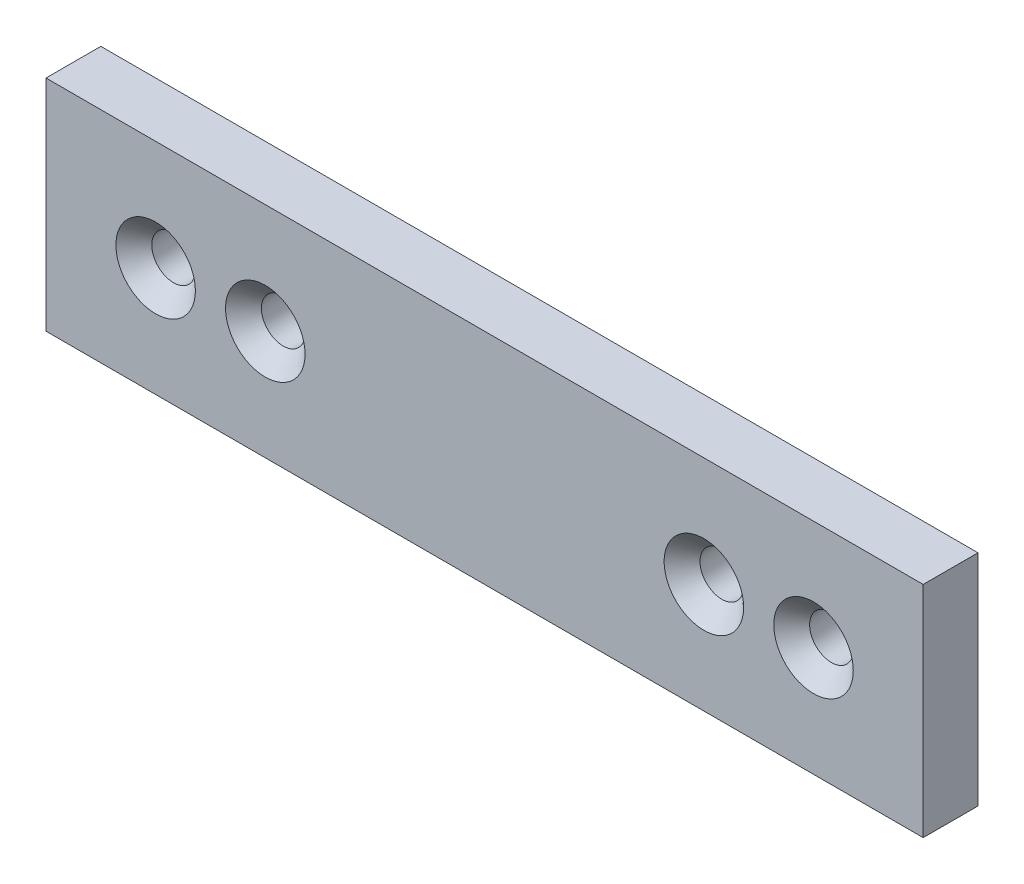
ISO-10303-21;
HEADER;
FILE_DESCRIPTION(('STEP AP214'),'2;1');
FILE_NAME('part.step','',(''),(''),'','','');
FILE_SCHEMA(('AUTOMOTIVE_DESIGN { 1 0 10303 214 1 1 1 1 }'));
ENDSEC;
DATA;
#1=APPLICATION_CONTEXT('core data for automotive mechanical design processes');
#2=APPLICATION_PROTOCOL_DEFINITION('international standard','automotive_design',2000,#1);
#3=PRODUCT_CONTEXT('',#1,'mechanical');
#4=PRODUCT('Part','Part','',(#3));
#5=PRODUCT_RELATED_PRODUCT_CATEGORY('part','',(#4));
#6=PRODUCT_DEFINITION_FORMATION('','',#4);
#7=PRODUCT_DEFINITION_CONTEXT('part definition',#1,'design');
#8=PRODUCT_DEFINITION('design','',#6,#7);
#9=PRODUCT_DEFINITION_SHAPE('','',#8);
#10=(LENGTH_UNIT() NAMED_UNIT(*) SI_UNIT(.MILLI.,.METRE.));
#11=(NAMED_UNIT(*) PLANE_ANGLE_UNIT() SI_UNIT($,.RADIAN.));
#12=(NAMED_UNIT(*) SI_UNIT($,.STERADIAN.) SOLID_ANGLE_UNIT());
#13=UNCERTAINTY_MEASURE_WITH_UNIT(LENGTH_MEASURE(1.E-05),#10,'distance_accuracy_value','');
#14=(GEOMETRIC_REPRESENTATION_CONTEXT(3) GLOBAL_UNCERTAINTY_ASSIGNED_CONTEXT((#13)) GLOBAL_UNIT_ASSIGNED_CONTEXT((#10,
#11,#12)) REPRESENTATION_CONTEXT('',''));
#15=CARTESIAN_POINT('',(0.,0.,0.));
#16=DIRECTION('',(0.,0.,1.));
#17=DIRECTION('',(1.,0.,0.));
#18=AXIS2_PLACEMENT_3D('',#15,#16,#17);
#19=CARTESIAN_POINT('',(-73.3680960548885,17.4271012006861,6.35));
#20=DIRECTION('',(1.,0.,0.));
#21=DIRECTION('',(0.,0.,-1.));
#22=AXIS2_PLACEMENT_3D('',#19,#20,#21);
#23=PLANE('',#22);
#24=DIRECTION('',(0.,-1.,0.));
#25=VECTOR('',#24,1.);
#26=CARTESIAN_POINT('',(-73.3680960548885,17.4271012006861,0.));
#27=LINE('',#26,#25);
#28=CARTESIAN_POINT('',(-73.3680960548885,17.4271012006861,0.));
#29=VERTEX_POINT('',#28);
#30=CARTESIAN_POINT('',(-73.3680960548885,-7.97289879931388,0.));
#31=VERTEX_POINT('',#30);
#32=EDGE_CURVE('E109',#29,#31,#27,.T.);
#33=ORIENTED_EDGE('',*,*,#32,.T.);
#34=DIRECTION('',(0.,0.,-1.));
#35=VECTOR('',#34,1.);
#36=CARTESIAN_POINT('',(-73.3680960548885,-7.97289879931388,6.35));
#37=LINE('',#36,#35);
#38=CARTESIAN_POINT('',(-73.3680960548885,-7.97289879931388,6.35));
#39=VERTEX_POINT('',#38);
#40=EDGE_CURVE('E11',#39,#31,#37,.T.);
#41=ORIENTED_EDGE('',*,*,#40,.F.);
#42=DIRECTION('',(0.,-1.,0.));
#43=VECTOR('',#42,1.);
#44=CARTESIAN_POINT('',(-73.3680960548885,17.4271012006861,6.35));
#45=LINE('',#44,#43);
#46=CARTESIAN_POINT('',(-73.3680960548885,17.4271012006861,6.35));
#47=VERTEX_POINT('',#46);
#48=EDGE_CURVE('E92',#47,#39,#45,.T.);
#49=ORIENTED_EDGE('',*,*,#48,.F.);
#50=DIRECTION('',(0.,0.,-1.));
#51=VECTOR('',#50,1.);
#52=CARTESIAN_POINT('',(-73.3680960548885,17.4271012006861,6.35));
#53=LINE('',#52,#51);
#54=EDGE_CURVE('E105',#47,#29,#53,.T.);
#55=ORIENTED_EDGE('',*,*,#54,.T.);
#56=EDGE_LOOP('',(#33,#41,#49,#55));
#57=FACE_BOUND('',#56,.T.);
#58=ADVANCED_FACE('F40',(#57),#23,.F.);
#59=CARTESIAN_POINT('',(-73.3680960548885,-7.97289879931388,6.35));
#60=DIRECTION('',(0.,1.,0.));
#61=DIRECTION('',(0.,0.,1.));
#62=AXIS2_PLACEMENT_3D('',#59,#60,#61);
#63=PLANE('',#62);
#64=DIRECTION('',(1.,0.,0.));
#65=VECTOR('',#64,1.);
#66=CARTESIAN_POINT('',(-73.3680960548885,-7.97289879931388,0.));
#67=LINE('',#66,#65);
#68=CARTESIAN_POINT('',(28.2319039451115,-7.97289879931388,0.));
#69=VERTEX_POINT('',#68);
#70=EDGE_CURVE('E97',#31,#69,#67,.T.);
#71=ORIENTED_EDGE('',*,*,#70,.T.);
#72=DIRECTION('',(0.,0.,-1.));
#73=VECTOR('',#72,1.);
#74=CARTESIAN_POINT('',(28.2319039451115,-7.97289879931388,6.35));
#75=LINE('',#74,#73);
#76=CARTESIAN_POINT('',(28.2319039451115,-7.97289879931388,6.35));
#77=VERTEX_POINT('',#76);
#78=EDGE_CURVE('E49',#77,#69,#75,.T.);
#79=ORIENTED_EDGE('',*,*,#78,.F.);
#80=DIRECTION('',(1.,0.,0.));
#81=VECTOR('',#80,1.);
#82=CARTESIAN_POINT('',(-73.3680960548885,-7.97289879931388,6.35));
#83=LINE('',#82,#81);
#84=EDGE_CURVE('E87',#39,#77,#83,.T.);
#85=ORIENTED_EDGE('',*,*,#84,.F.);
#86=ORIENTED_EDGE('',*,*,#40,.T.);
#87=EDGE_LOOP('',(#71,#79,#85,#86));
#88=FACE_BOUND('',#87,.T.);
#89=ADVANCED_FACE('F96',(#88),#63,.F.);
#90=CARTESIAN_POINT('',(28.2319039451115,17.4271012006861,6.35));
#91=DIRECTION('',(-1.,0.,0.));
#92=DIRECTION('',(0.,0.,1.));
#93=AXIS2_PLACEMENT_3D('',#90,#91,#92);
#94=PLANE('',#93);
#95=DIRECTION('',(0.,1.,0.));
#96=VECTOR('',#95,1.);
#97=CARTESIAN_POINT('',(28.2319039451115,17.4271012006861,0.));
#98=LINE('',#97,#96);
#99=CARTESIAN_POINT('',(28.2319039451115,17.4271012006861,0.));
#100=VERTEX_POINT('',#99);
#101=EDGE_CURVE('E74',#69,#100,#98,.T.);
#102=ORIENTED_EDGE('',*,*,#101,.T.);
#103=DIRECTION('',(0.,0.,-1.));
#104=VECTOR('',#103,1.);
#105=CARTESIAN_POINT('',(28.2319039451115,17.4271012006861,6.35));
#106=LINE('',#105,#104);
#107=CARTESIAN_POINT('',(28.2319039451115,17.4271012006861,6.35));
#108=VERTEX_POINT('',#107);
#109=EDGE_CURVE('E99',#108,#100,#106,.T.);
#110=ORIENTED_EDGE('',*,*,#109,.F.);
#111=DIRECTION('',(0.,1.,0.));
#112=VECTOR('',#111,1.);
#113=CARTESIAN_POINT('',(28.2319039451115,17.4271012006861,6.35));
#114=LINE('',#113,#112);
#115=EDGE_CURVE('E90',#77,#108,#114,.T.);
#116=ORIENTED_EDGE('',*,*,#115,.F.);
#117=ORIENTED_EDGE('',*,*,#78,.T.);
#118=EDGE_LOOP('',(#102,#110,#116,#117));
#119=FACE_BOUND('',#118,.T.);
#120=ADVANCED_FACE('F100',(#119),#94,.F.);
#121=CARTESIAN_POINT('',(-73.3680960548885,17.4271012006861,6.35));
#122=DIRECTION('',(0.,-1.,0.));
#123=DIRECTION('',(0.,0.,-1.));
#124=AXIS2_PLACEMENT_3D('',#121,#122,#123);
#125=PLANE('',#124);
#126=DIRECTION('',(-1.,0.,0.));
#127=VECTOR('',#126,1.);
#128=CARTESIAN_POINT('',(-73.3680960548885,17.4271012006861,0.));
#129=LINE('',#128,#127);
#130=EDGE_CURVE('E80',#100,#29,#129,.T.);
#131=ORIENTED_EDGE('',*,*,#130,.T.);
#132=ORIENTED_EDGE('',*,*,#54,.F.);
#133=DIRECTION('',(-1.,0.,0.));
#134=VECTOR('',#133,1.);
#135=CARTESIAN_POINT('',(-73.3680960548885,17.4271012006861,6.35));
#136=LINE('',#135,#134);
#137=EDGE_CURVE('E57',#108,#47,#136,.T.);
#138=ORIENTED_EDGE('',*,*,#137,.F.);
#139=ORIENTED_EDGE('',*,*,#109,.T.);
#140=EDGE_LOOP('',(#131,#132,#138,#139));
#141=FACE_BOUND('',#140,.T.);
#142=ADVANCED_FACE('F124',(#141),#125,.F.);
#143=CARTESIAN_POINT('',(0.,0.,6.35));
#144=DIRECTION('',(0.,0.,1.));
#145=DIRECTION('',(1.,0.,0.));
#146=AXIS2_PLACEMENT_3D('',#143,#144,#145);
#147=PLANE('',#146);
#148=CARTESIAN_POINT('',(-60.6680960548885,4.72710120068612,6.35));
#149=DIRECTION('',(0.,0.,1.));
#150=DIRECTION('',(1.,0.,0.));
#151=AXIS2_PLACEMENT_3D('',#148,#149,#150);
#152=CIRCLE('',#151,4.60375);
#153=CARTESIAN_POINT('',(-56.0643460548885,4.72710120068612,6.35));
#154=VERTEX_POINT('',#153);
#155=EDGE_CURVE('E175',#154,#154,#152,.T.);
#156=ORIENTED_EDGE('',*,*,#155,.F.);
#157=EDGE_LOOP('',(#156));
#158=FACE_BOUND('',#157,.T.);
#159=CARTESIAN_POINT('',(-47.9680960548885,4.72710120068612,6.35));
#160=DIRECTION('',(0.,0.,1.));
#161=DIRECTION('',(1.,0.,0.));
#162=AXIS2_PLACEMENT_3D('',#159,#160,#161);
#163=CIRCLE('',#162,4.60375);
#164=CARTESIAN_POINT('',(-43.3643460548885,4.72710120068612,6.35));
#165=VERTEX_POINT('',#164);
#166=EDGE_CURVE('E163',#165,#165,#163,.T.);
#167=ORIENTED_EDGE('',*,*,#166,.F.);
#168=EDGE_LOOP('',(#167));
#169=FACE_BOUND('',#168,.T.);
#170=CARTESIAN_POINT('',(2.83190394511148,4.72710120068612,6.35));
#171=DIRECTION('',(0.,0.,1.));
#172=DIRECTION('',(1.,0.,0.));
#173=AXIS2_PLACEMENT_3D('',#170,#171,#172);
#174=CIRCLE('',#173,4.60375);
#175=CARTESIAN_POINT('',(7.43565394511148,4.72710120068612,6.35));
#176=VERTEX_POINT('',#175);
#177=EDGE_CURVE('E151',#176,#176,#174,.T.);
#178=ORIENTED_EDGE('',*,*,#177,.F.);
#179=EDGE_LOOP('',(#178));
#180=FACE_BOUND('',#179,.T.);
#181=CARTESIAN_POINT('',(15.5319039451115,4.72710120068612,6.35));
#182=DIRECTION('',(0.,0.,1.));
#183=DIRECTION('',(1.,0.,0.));
#184=AXIS2_PLACEMENT_3D('',#181,#182,#183);
#185=CIRCLE('',#184,4.60375);
#186=CARTESIAN_POINT('',(20.1356539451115,4.72710120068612,6.35));
#187=VERTEX_POINT('',#186);
#188=EDGE_CURVE('E139',#187,#187,#185,.T.);
#189=ORIENTED_EDGE('',*,*,#188,.F.);
#190=EDGE_LOOP('',(#189));
#191=FACE_BOUND('',#190,.T.);
#192=ORIENTED_EDGE('',*,*,#48,.T.);
#193=ORIENTED_EDGE('',*,*,#84,.T.);
#194=ORIENTED_EDGE('',*,*,#115,.T.);
#195=ORIENTED_EDGE('',*,*,#137,.T.);
#196=EDGE_LOOP('',(#192,#193,#194,#195));
#197=FACE_BOUND('',#196,.T.);
#198=ADVANCED_FACE('F88',(#158,#169,#180,#191,#197),#147,.T.);
#199=CARTESIAN_POINT('',(0.,0.,0.));
#200=DIRECTION('',(0.,0.,1.));
#201=DIRECTION('',(1.,0.,0.));
#202=AXIS2_PLACEMENT_3D('',#199,#200,#201);
#203=PLANE('',#202);
#204=CARTESIAN_POINT('',(-60.6680960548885,4.72710120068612,0.));
#205=DIRECTION('',(0.,0.,1.));
#206=DIRECTION('',(1.,0.,0.));
#207=AXIS2_PLACEMENT_3D('',#204,#205,#206);
#208=CIRCLE('',#207,2.5273);
#209=CARTESIAN_POINT('',(-58.1407960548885,4.72710120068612,0.));
#210=VERTEX_POINT('',#209);
#211=EDGE_CURVE('E167',#210,#210,#208,.T.);
#212=ORIENTED_EDGE('',*,*,#211,.T.);
#213=EDGE_LOOP('',(#212));
#214=FACE_BOUND('',#213,.T.);
#215=CARTESIAN_POINT('',(-47.9680960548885,4.72710120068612,0.));
#216=DIRECTION('',(0.,0.,1.));
#217=DIRECTION('',(1.,0.,0.));
#218=AXIS2_PLACEMENT_3D('',#215,#216,#217);
#219=CIRCLE('',#218,2.5273);
#220=CARTESIAN_POINT('',(-45.4407960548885,4.72710120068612,0.));
#221=VERTEX_POINT('',#220);
#222=EDGE_CURVE('E155',#221,#221,#219,.T.);
#223=ORIENTED_EDGE('',*,*,#222,.T.);
#224=EDGE_LOOP('',(#223));
#225=FACE_BOUND('',#224,.T.);
#226=CARTESIAN_POINT('',(2.83190394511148,4.72710120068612,0.));
#227=DIRECTION('',(0.,0.,1.));
#228=DIRECTION('',(1.,0.,0.));
#229=AXIS2_PLACEMENT_3D('',#226,#227,#228);
#230=CIRCLE('',#229,2.5273);
#231=CARTESIAN_POINT('',(5.35920394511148,4.72710120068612,0.));
#232=VERTEX_POINT('',#231);
#233=EDGE_CURVE('E143',#232,#232,#230,.T.);
#234=ORIENTED_EDGE('',*,*,#233,.T.);
#235=EDGE_LOOP('',(#234));
#236=FACE_BOUND('',#235,.T.);
#237=CARTESIAN_POINT('',(15.5319039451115,4.72710120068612,0.));
#238=DIRECTION('',(0.,0.,1.));
#239=DIRECTION('',(1.,0.,0.));
#240=AXIS2_PLACEMENT_3D('',#237,#238,#239);
#241=CIRCLE('',#240,2.5273);
#242=CARTESIAN_POINT('',(18.0592039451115,4.72710120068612,0.));
#243=VERTEX_POINT('',#242);
#244=EDGE_CURVE('E113',#243,#243,#241,.T.);
#245=ORIENTED_EDGE('',*,*,#244,.T.);
#246=EDGE_LOOP('',(#245));
#247=FACE_BOUND('',#246,.T.);
#248=ORIENTED_EDGE('',*,*,#32,.F.);
#249=ORIENTED_EDGE('',*,*,#130,.F.);
#250=ORIENTED_EDGE('',*,*,#101,.F.);
#251=ORIENTED_EDGE('',*,*,#70,.F.);
#252=EDGE_LOOP('',(#248,#249,#250,#251));
#253=FACE_BOUND('',#252,.T.);
#254=ADVANCED_FACE('F127',(#214,#225,#236,#247,#253),#203,.F.);
#255=CARTESIAN_POINT('',(15.5319039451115,4.72710120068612,6.35));
#256=DIRECTION('',(0.,0.,1.));
#257=DIRECTION('',(1.,0.,0.));
#258=AXIS2_PLACEMENT_3D('',#255,#256,#257);
#259=CYLINDRICAL_SURFACE('',#258,2.5273);
#260=ORIENTED_EDGE('',*,*,#244,.F.);
#261=EDGE_LOOP('',(#260));
#262=FACE_BOUND('',#261,.T.);
#263=CARTESIAN_POINT('',(15.5319039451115,4.72710120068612,4.27355));
#264=DIRECTION('',(0.,0.,1.));
#265=DIRECTION('',(1.,0.,0.));
#266=AXIS2_PLACEMENT_3D('',#263,#264,#265);
#267=CIRCLE('',#266,2.5273);
#268=CARTESIAN_POINT('',(18.0592039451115,4.72710120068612,4.27355));
#269=VERTEX_POINT('',#268);
#270=EDGE_CURVE('E135',#269,#269,#267,.T.);
#271=ORIENTED_EDGE('',*,*,#270,.T.);
#272=EDGE_LOOP('',(#271));
#273=FACE_BOUND('',#272,.T.);
#274=ADVANCED_FACE('F195',(#262,#273),#259,.F.);
#275=CARTESIAN_POINT('',(15.5319039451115,4.72710120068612,6.35));
#276=DIRECTION('',(0.,0.,1.));
#277=DIRECTION('',(1.,0.,0.));
#278=AXIS2_PLACEMENT_3D('',#275,#276,#277);
#279=CONICAL_SURFACE('',#278,4.60375,0.785398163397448);
#280=ORIENTED_EDGE('',*,*,#270,.F.);
#281=EDGE_LOOP('',(#280));
#282=FACE_BOUND('',#281,.T.);
#283=ORIENTED_EDGE('',*,*,#188,.T.);
#284=EDGE_LOOP('',(#283));
#285=FACE_BOUND('',#284,.T.);
#286=ADVANCED_FACE('F192',(#282,#285),#279,.F.);
#287=CARTESIAN_POINT('',(2.83190394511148,4.72710120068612,6.35));
#288=DIRECTION('',(0.,0.,1.));
#289=DIRECTION('',(1.,0.,0.));
#290=AXIS2_PLACEMENT_3D('',#287,#288,#289);
#291=CYLINDRICAL_SURFACE('',#290,2.5273);
#292=ORIENTED_EDGE('',*,*,#233,.F.);
#293=EDGE_LOOP('',(#292));
#294=FACE_BOUND('',#293,.T.);
#295=CARTESIAN_POINT('',(2.83190394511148,4.72710120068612,4.27355));
#296=DIRECTION('',(0.,0.,1.));
#297=DIRECTION('',(1.,0.,0.));
#298=AXIS2_PLACEMENT_3D('',#295,#296,#297);
#299=CIRCLE('',#298,2.5273);
#300=CARTESIAN_POINT('',(5.35920394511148,4.72710120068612,4.27355));
#301=VERTEX_POINT('',#300);
#302=EDGE_CURVE('E147',#301,#301,#299,.T.);
#303=ORIENTED_EDGE('',*,*,#302,.T.);
#304=EDGE_LOOP('',(#303));
#305=FACE_BOUND('',#304,.T.);
#306=ADVANCED_FACE('F194',(#294,#305),#291,.F.);
#307=CARTESIAN_POINT('',(2.83190394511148,4.72710120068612,6.35));
#308=DIRECTION('',(0.,0.,1.));
#309=DIRECTION('',(1.,0.,0.));
#310=AXIS2_PLACEMENT_3D('',#307,#308,#309);
#311=CONICAL_SURFACE('',#310,4.60375,0.785398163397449);
#312=ORIENTED_EDGE('',*,*,#302,.F.);
#313=EDGE_LOOP('',(#312));
#314=FACE_BOUND('',#313,.T.);
#315=ORIENTED_EDGE('',*,*,#177,.T.);
#316=EDGE_LOOP('',(#315));
#317=FACE_BOUND('',#316,.T.);
#318=ADVANCED_FACE('F202',(#314,#317),#311,.F.);
#319=CARTESIAN_POINT('',(-47.9680960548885,4.72710120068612,6.35));
#320=DIRECTION('',(0.,0.,1.));
#321=DIRECTION('',(1.,0.,0.));
#322=AXIS2_PLACEMENT_3D('',#319,#320,#321);
#323=CYLINDRICAL_SURFACE('',#322,2.5273);
#324=ORIENTED_EDGE('',*,*,#222,.F.);
#325=EDGE_LOOP('',(#324));
#326=FACE_BOUND('',#325,.T.);
#327=CARTESIAN_POINT('',(-47.9680960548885,4.72710120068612,4.27355));
#328=DIRECTION('',(0.,0.,1.));
#329=DIRECTION('',(1.,0.,0.));
#330=AXIS2_PLACEMENT_3D('',#327,#328,#329);
#331=CIRCLE('',#330,2.5273);
#332=CARTESIAN_POINT('',(-45.4407960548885,4.72710120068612,4.27355));
#333=VERTEX_POINT('',#332);
#334=EDGE_CURVE('E159',#333,#333,#331,.T.);
#335=ORIENTED_EDGE('',*,*,#334,.T.);
#336=EDGE_LOOP('',(#335));
#337=FACE_BOUND('',#336,.T.);
#338=ADVANCED_FACE('F236',(#326,#337),#323,.F.);
#339=CARTESIAN_POINT('',(-47.9680960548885,4.72710120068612,6.35));
#340=DIRECTION('',(0.,0.,1.));
#341=DIRECTION('',(1.,0.,0.));
#342=AXIS2_PLACEMENT_3D('',#339,#340,#341);
#343=CONICAL_SURFACE('',#342,4.60375,0.78539816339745);
#344=ORIENTED_EDGE('',*,*,#334,.F.);
#345=EDGE_LOOP('',(#344));
#346=FACE_BOUND('',#345,.T.);
#347=ORIENTED_EDGE('',*,*,#166,.T.);
#348=EDGE_LOOP('',(#347));
#349=FACE_BOUND('',#348,.T.);
#350=ADVANCED_FACE('F241',(#346,#349),#343,.F.);
#351=CARTESIAN_POINT('',(-60.6680960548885,4.72710120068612,6.35));
#352=DIRECTION('',(0.,0.,1.));
#353=DIRECTION('',(1.,0.,0.));
#354=AXIS2_PLACEMENT_3D('',#351,#352,#353);
#355=CYLINDRICAL_SURFACE('',#354,2.5273);
#356=ORIENTED_EDGE('',*,*,#211,.F.);
#357=EDGE_LOOP('',(#356));
#358=FACE_BOUND('',#357,.T.);
#359=CARTESIAN_POINT('',(-60.6680960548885,4.72710120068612,4.27355));
#360=DIRECTION('',(0.,0.,1.));
#361=DIRECTION('',(1.,0.,0.));
#362=AXIS2_PLACEMENT_3D('',#359,#360,#361);
#363=CIRCLE('',#362,2.5273);
#364=CARTESIAN_POINT('',(-58.1407960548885,4.72710120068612,4.27355));
#365=VERTEX_POINT('',#364);
#366=EDGE_CURVE('E171',#365,#365,#363,.T.);
#367=ORIENTED_EDGE('',*,*,#366,.T.);
#368=EDGE_LOOP('',(#367));
#369=FACE_BOUND('',#368,.T.);
#370=ADVANCED_FACE('F247',(#358,#369),#355,.F.);
#371=CARTESIAN_POINT('',(-60.6680960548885,4.72710120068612,6.35));
#372=DIRECTION('',(0.,0.,1.));
#373=DIRECTION('',(1.,0.,0.));
#374=AXIS2_PLACEMENT_3D('',#371,#372,#373);
#375=CONICAL_SURFACE('',#374,4.60375,0.78539816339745);
#376=ORIENTED_EDGE('',*,*,#366,.F.);
#377=EDGE_LOOP('',(#376));
#378=FACE_BOUND('',#377,.T.);
#379=ORIENTED_EDGE('',*,*,#155,.T.);
#380=EDGE_LOOP('',(#379));
#381=FACE_BOUND('',#380,.T.);
#382=ADVANCED_FACE('F181',(#378,#381),#375,.F.);
#383=CLOSED_SHELL('',(#58,#89,#120,#142,#198,#254,#274,#286,#306,#318,#338,#350,#370,#382));
#384=MANIFOLD_SOLID_BREP('B2',#383);
#385=ADVANCED_BREP_SHAPE_REPRESENTATION('',(#18,#384),#14);
#386=SHAPE_DEFINITION_REPRESENTATION(#9,#385);
ENDSEC;
END-ISO-10303-21;
